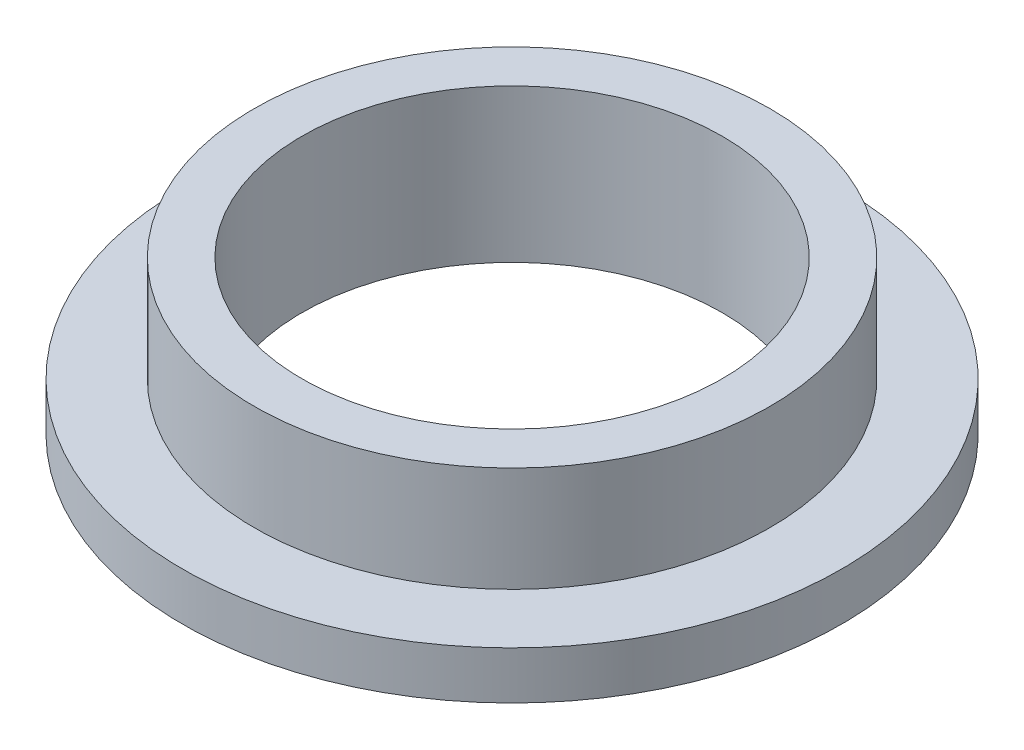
ISO-10303-21;
HEADER;
FILE_DESCRIPTION(('STEP AP214'),'2;1');
FILE_NAME('part.step','',(''),(''),'','','');
FILE_SCHEMA(('AUTOMOTIVE_DESIGN { 1 0 10303 214 1 1 1 1 }'));
ENDSEC;
DATA;
#1=APPLICATION_CONTEXT('core data for automotive mechanical design processes');
#2=APPLICATION_PROTOCOL_DEFINITION('international standard','automotive_design',2000,#1);
#3=PRODUCT_CONTEXT('',#1,'mechanical');
#4=PRODUCT('Part','Part','',(#3));
#5=PRODUCT_RELATED_PRODUCT_CATEGORY('part','',(#4));
#6=PRODUCT_DEFINITION_FORMATION('','',#4);
#7=PRODUCT_DEFINITION_CONTEXT('part definition',#1,'design');
#8=PRODUCT_DEFINITION('design','',#6,#7);
#9=PRODUCT_DEFINITION_SHAPE('','',#8);
#10=(LENGTH_UNIT() NAMED_UNIT(*) SI_UNIT(.MILLI.,.METRE.));
#11=(NAMED_UNIT(*) PLANE_ANGLE_UNIT() SI_UNIT($,.RADIAN.));
#12=(NAMED_UNIT(*) SI_UNIT($,.STERADIAN.) SOLID_ANGLE_UNIT());
#13=UNCERTAINTY_MEASURE_WITH_UNIT(LENGTH_MEASURE(1.E-05),#10,'distance_accuracy_value','');
#14=(GEOMETRIC_REPRESENTATION_CONTEXT(3) GLOBAL_UNCERTAINTY_ASSIGNED_CONTEXT((#13)) GLOBAL_UNIT_ASSIGNED_CONTEXT((#10,
#11,#12)) REPRESENTATION_CONTEXT('',''));
#15=CARTESIAN_POINT('',(0.,0.,0.));
#16=DIRECTION('',(0.,0.,1.));
#17=DIRECTION('',(1.,0.,0.));
#18=AXIS2_PLACEMENT_3D('',#15,#16,#17);
#19=CARTESIAN_POINT('',(0.,0.,0.));
#20=DIRECTION('',(0.,-1.,0.));
#21=DIRECTION('',(0.,0.,-1.));
#22=AXIS2_PLACEMENT_3D('',#19,#20,#21);
#23=CYLINDRICAL_SURFACE('',#22,3.45);
#24=CARTESIAN_POINT('',(0.,0.5,0.));
#25=DIRECTION('',(0.,-1.,0.));
#26=DIRECTION('',(0.,0.,-1.));
#27=AXIS2_PLACEMENT_3D('',#24,#25,#26);
#28=CIRCLE('',#27,3.45);
#29=CARTESIAN_POINT('',(0.,0.5,-3.45));
#30=VERTEX_POINT('',#29);
#31=EDGE_CURVE('E10',#30,#30,#28,.T.);
#32=ORIENTED_EDGE('',*,*,#31,.T.);
#33=EDGE_LOOP('',(#32));
#34=FACE_BOUND('',#33,.T.);
#35=CARTESIAN_POINT('',(0.,0.,0.));
#36=DIRECTION('',(0.,-1.,0.));
#37=DIRECTION('',(0.,0.,-1.));
#38=AXIS2_PLACEMENT_3D('',#35,#36,#37);
#39=CIRCLE('',#38,3.45);
#40=CARTESIAN_POINT('',(0.,0.,-3.45));
#41=VERTEX_POINT('',#40);
#42=EDGE_CURVE('E51',#41,#41,#39,.T.);
#43=ORIENTED_EDGE('',*,*,#42,.F.);
#44=EDGE_LOOP('',(#43));
#45=FACE_BOUND('',#44,.T.);
#46=ADVANCED_FACE('F29',(#34,#45),#23,.T.);
#47=CARTESIAN_POINT('',(2.7,0.5,0.));
#48=DIRECTION('',(0.,1.,0.));
#49=DIRECTION('',(0.,0.,1.));
#50=AXIS2_PLACEMENT_3D('',#47,#48,#49);
#51=PLANE('',#50);
#52=CARTESIAN_POINT('',(0.,0.5,0.));
#53=DIRECTION('',(0.,-1.,0.));
#54=DIRECTION('',(0.,0.,-1.));
#55=AXIS2_PLACEMENT_3D('',#52,#53,#54);
#56=CIRCLE('',#55,2.7);
#57=CARTESIAN_POINT('',(0.,0.5,-2.7));
#58=VERTEX_POINT('',#57);
#59=EDGE_CURVE('E35',#58,#58,#56,.T.);
#60=ORIENTED_EDGE('',*,*,#59,.T.);
#61=EDGE_LOOP('',(#60));
#62=FACE_BOUND('',#61,.T.);
#63=ORIENTED_EDGE('',*,*,#31,.F.);
#64=EDGE_LOOP('',(#63));
#65=FACE_BOUND('',#64,.T.);
#66=ADVANCED_FACE('F59',(#62,#65),#51,.T.);
#67=CARTESIAN_POINT('',(0.,0.,0.));
#68=DIRECTION('',(0.,-1.,0.));
#69=DIRECTION('',(0.,0.,-1.));
#70=AXIS2_PLACEMENT_3D('',#67,#68,#69);
#71=CYLINDRICAL_SURFACE('',#70,2.7);
#72=CARTESIAN_POINT('',(0.,1.6,0.));
#73=DIRECTION('',(0.,-1.,0.));
#74=DIRECTION('',(0.,0.,-1.));
#75=AXIS2_PLACEMENT_3D('',#72,#73,#74);
#76=CIRCLE('',#75,2.7);
#77=CARTESIAN_POINT('',(0.,1.6,-2.7));
#78=VERTEX_POINT('',#77);
#79=EDGE_CURVE('E39',#78,#78,#76,.T.);
#80=ORIENTED_EDGE('',*,*,#79,.T.);
#81=EDGE_LOOP('',(#80));
#82=FACE_BOUND('',#81,.T.);
#83=ORIENTED_EDGE('',*,*,#59,.F.);
#84=EDGE_LOOP('',(#83));
#85=FACE_BOUND('',#84,.T.);
#86=ADVANCED_FACE('F63',(#82,#85),#71,.T.);
#87=CARTESIAN_POINT('',(2.2,1.6,0.));
#88=DIRECTION('',(0.,1.,0.));
#89=DIRECTION('',(0.,0.,1.));
#90=AXIS2_PLACEMENT_3D('',#87,#88,#89);
#91=PLANE('',#90);
#92=CARTESIAN_POINT('',(0.,1.6,0.));
#93=DIRECTION('',(0.,-1.,0.));
#94=DIRECTION('',(0.,0.,-1.));
#95=AXIS2_PLACEMENT_3D('',#92,#93,#94);
#96=CIRCLE('',#95,2.2);
#97=CARTESIAN_POINT('',(0.,1.6,-2.2));
#98=VERTEX_POINT('',#97);
#99=EDGE_CURVE('E43',#98,#98,#96,.T.);
#100=ORIENTED_EDGE('',*,*,#99,.T.);
#101=EDGE_LOOP('',(#100));
#102=FACE_BOUND('',#101,.T.);
#103=ORIENTED_EDGE('',*,*,#79,.F.);
#104=EDGE_LOOP('',(#103));
#105=FACE_BOUND('',#104,.T.);
#106=ADVANCED_FACE('F67',(#102,#105),#91,.T.);
#107=CARTESIAN_POINT('',(0.,0.,0.));
#108=DIRECTION('',(0.,-1.,0.));
#109=DIRECTION('',(0.,0.,-1.));
#110=AXIS2_PLACEMENT_3D('',#107,#108,#109);
#111=CYLINDRICAL_SURFACE('',#110,2.2);
#112=CARTESIAN_POINT('',(0.,0.,0.));
#113=DIRECTION('',(0.,-1.,0.));
#114=DIRECTION('',(0.,0.,-1.));
#115=AXIS2_PLACEMENT_3D('',#112,#113,#114);
#116=CIRCLE('',#115,2.2);
#117=CARTESIAN_POINT('',(0.,0.,-2.2));
#118=VERTEX_POINT('',#117);
#119=EDGE_CURVE('E48',#118,#118,#116,.T.);
#120=ORIENTED_EDGE('',*,*,#119,.T.);
#121=EDGE_LOOP('',(#120));
#122=FACE_BOUND('',#121,.T.);
#123=ORIENTED_EDGE('',*,*,#99,.F.);
#124=EDGE_LOOP('',(#123));
#125=FACE_BOUND('',#124,.T.);
#126=ADVANCED_FACE('F74',(#122,#125),#111,.F.);
#127=CARTESIAN_POINT('',(3.45,0.,0.));
#128=DIRECTION('',(0.,-1.,0.));
#129=DIRECTION('',(0.,0.,-1.));
#130=AXIS2_PLACEMENT_3D('',#127,#128,#129);
#131=PLANE('',#130);
#132=ORIENTED_EDGE('',*,*,#42,.T.);
#133=EDGE_LOOP('',(#132));
#134=FACE_BOUND('',#133,.T.);
#135=ORIENTED_EDGE('',*,*,#119,.F.);
#136=EDGE_LOOP('',(#135));
#137=FACE_BOUND('',#136,.T.);
#138=ADVANCED_FACE('F55',(#134,#137),#131,.T.);
#139=CLOSED_SHELL('',(#46,#66,#86,#106,#126,#138));
#140=MANIFOLD_SOLID_BREP('B2',#139);
#141=ADVANCED_BREP_SHAPE_REPRESENTATION('',(#18,#140),#14);
#142=SHAPE_DEFINITION_REPRESENTATION(#9,#141);
ENDSEC;
END-ISO-10303-21;
